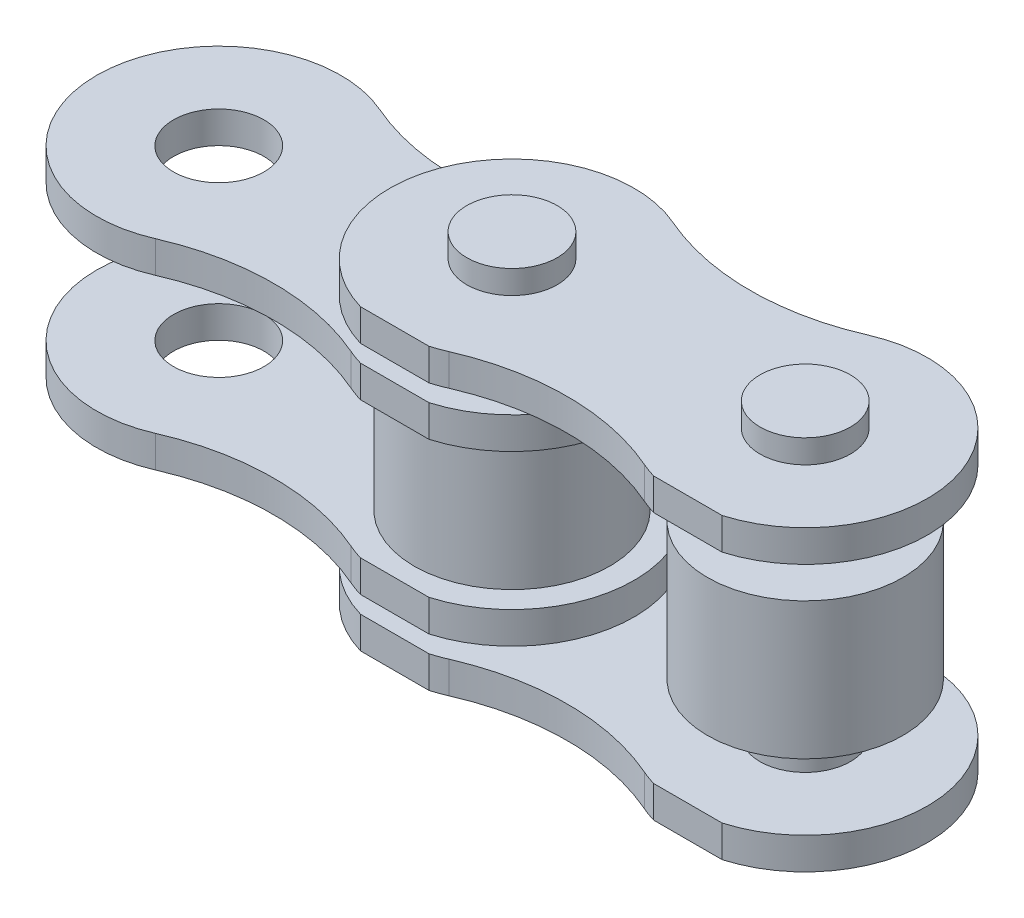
ISO-10303-21;
HEADER;
FILE_DESCRIPTION(('STEP AP214'),'2;1');
FILE_NAME('part.step','',(''),(''),'','','');
FILE_SCHEMA(('AUTOMOTIVE_DESIGN { 1 0 10303 214 1 1 1 1 }'));
ENDSEC;
DATA;
#1=APPLICATION_CONTEXT('core data for automotive mechanical design processes');
#2=APPLICATION_PROTOCOL_DEFINITION('international standard','automotive_design',2000,#1);
#3=PRODUCT_CONTEXT('',#1,'mechanical');
#4=PRODUCT('Part','Part','',(#3));
#5=PRODUCT_RELATED_PRODUCT_CATEGORY('part','',(#4));
#6=PRODUCT_DEFINITION_FORMATION('','',#4);
#7=PRODUCT_DEFINITION_CONTEXT('part definition',#1,'design');
#8=PRODUCT_DEFINITION('design','',#6,#7);
#9=PRODUCT_DEFINITION_SHAPE('','',#8);
#10=(LENGTH_UNIT() NAMED_UNIT(*) SI_UNIT(.MILLI.,.METRE.));
#11=(NAMED_UNIT(*) PLANE_ANGLE_UNIT() SI_UNIT($,.RADIAN.));
#12=(NAMED_UNIT(*) SI_UNIT($,.STERADIAN.) SOLID_ANGLE_UNIT());
#13=UNCERTAINTY_MEASURE_WITH_UNIT(LENGTH_MEASURE(1.E-05),#10,'distance_accuracy_value','');
#14=(GEOMETRIC_REPRESENTATION_CONTEXT(3) GLOBAL_UNCERTAINTY_ASSIGNED_CONTEXT((#13)) GLOBAL_UNIT_ASSIGNED_CONTEXT((#10,
#11,#12)) REPRESENTATION_CONTEXT('',''));
#15=CARTESIAN_POINT('',(0.,0.,0.));
#16=DIRECTION('',(0.,0.,1.));
#17=DIRECTION('',(1.,0.,0.));
#18=AXIS2_PLACEMENT_3D('',#15,#16,#17);
#19=CARTESIAN_POINT('',(12.,-1.5,0.));
#20=DIRECTION('',(0.,-1.,0.));
#21=DIRECTION('',(0.,0.,-1.));
#22=AXIS2_PLACEMENT_3D('',#19,#20,#21);
#23=PLANE('',#22);
#24=CARTESIAN_POINT('',(12.,-1.5,0.));
#25=DIRECTION('',(0.,1.,0.));
#26=DIRECTION('',(0.,0.,1.));
#27=AXIS2_PLACEMENT_3D('',#24,#25,#26);
#28=CIRCLE('',#27,0.925);
#29=CARTESIAN_POINT('',(12.,-1.5,0.925));
#30=VERTEX_POINT('',#29);
#31=EDGE_CURVE('E591',#30,#30,#28,.T.);
#32=ORIENTED_EDGE('',*,*,#31,.F.);
#33=EDGE_LOOP('',(#32));
#34=FACE_BOUND('',#33,.T.);
#35=ADVANCED_FACE('F16',(#34),#23,.T.);
#36=CARTESIAN_POINT('',(6.,-1.5,0.));
#37=DIRECTION('',(0.,-1.,0.));
#38=DIRECTION('',(0.,0.,-1.));
#39=AXIS2_PLACEMENT_3D('',#36,#37,#38);
#40=PLANE('',#39);
#41=CARTESIAN_POINT('',(6.,-1.5,0.));
#42=DIRECTION('',(0.,1.,0.));
#43=DIRECTION('',(0.,0.,1.));
#44=AXIS2_PLACEMENT_3D('',#41,#42,#43);
#45=CIRCLE('',#44,0.925);
#46=CARTESIAN_POINT('',(6.,-1.5,0.925));
#47=VERTEX_POINT('',#46);
#48=EDGE_CURVE('E586',#47,#47,#45,.T.);
#49=ORIENTED_EDGE('',*,*,#48,.F.);
#50=EDGE_LOOP('',(#49));
#51=FACE_BOUND('',#50,.T.);
#52=ADVANCED_FACE('F600',(#51),#40,.T.);
#53=CARTESIAN_POINT('',(12.,2.04,0.));
#54=DIRECTION('',(0.,1.,0.));
#55=DIRECTION('',(0.,0.,1.));
#56=AXIS2_PLACEMENT_3D('',#53,#54,#55);
#57=CYLINDRICAL_SURFACE('',#56,0.925);
#58=ORIENTED_EDGE('',*,*,#31,.T.);
#59=EDGE_LOOP('',(#58));
#60=FACE_BOUND('',#59,.T.);
#61=CARTESIAN_POINT('',(12.,-1.,0.));
#62=DIRECTION('',(0.,1.,0.));
#63=DIRECTION('',(0.,0.,1.));
#64=AXIS2_PLACEMENT_3D('',#61,#62,#63);
#65=CIRCLE('',#64,0.925);
#66=CARTESIAN_POINT('',(12.,-1.,0.925));
#67=VERTEX_POINT('',#66);
#68=EDGE_CURVE('E577',#67,#67,#65,.T.);
#69=ORIENTED_EDGE('',*,*,#68,.F.);
#70=EDGE_LOOP('',(#69));
#71=FACE_BOUND('',#70,.T.);
#72=ADVANCED_FACE('F596',(#60,#71),#57,.T.);
#73=CARTESIAN_POINT('',(6.,2.04,0.));
#74=DIRECTION('',(0.,1.,0.));
#75=DIRECTION('',(0.,0.,1.));
#76=AXIS2_PLACEMENT_3D('',#73,#74,#75);
#77=CYLINDRICAL_SURFACE('',#76,0.925);
#78=ORIENTED_EDGE('',*,*,#48,.T.);
#79=EDGE_LOOP('',(#78));
#80=FACE_BOUND('',#79,.T.);
#81=CARTESIAN_POINT('',(6.,-1.,0.));
#82=DIRECTION('',(0.,1.,0.));
#83=DIRECTION('',(0.,0.,1.));
#84=AXIS2_PLACEMENT_3D('',#81,#82,#83);
#85=CIRCLE('',#84,0.925);
#86=CARTESIAN_POINT('',(6.,-1.,0.925));
#87=VERTEX_POINT('',#86);
#88=EDGE_CURVE('E573',#87,#87,#85,.T.);
#89=ORIENTED_EDGE('',*,*,#88,.F.);
#90=EDGE_LOOP('',(#89));
#91=FACE_BOUND('',#90,.T.);
#92=ADVANCED_FACE('F1051',(#80,#91),#77,.T.);
#93=CARTESIAN_POINT('',(6.,-1.,0.));
#94=DIRECTION('',(0.,-1.,0.));
#95=DIRECTION('',(0.,0.,-1.));
#96=AXIS2_PLACEMENT_3D('',#93,#94,#95);
#97=PLANE('',#96);
#98=ORIENTED_EDGE('',*,*,#88,.T.);
#99=EDGE_LOOP('',(#98));
#100=FACE_BOUND('',#99,.T.);
#101=ORIENTED_EDGE('',*,*,#68,.T.);
#102=EDGE_LOOP('',(#101));
#103=FACE_BOUND('',#102,.T.);
#104=CARTESIAN_POINT('',(9.,-1.,-6.874));
#105=DIRECTION('',(0.,1.,0.));
#106=DIRECTION('',(0.,0.,1.));
#107=AXIS2_PLACEMENT_3D('',#104,#105,#106);
#108=CIRCLE('',#107,5.);
#109=CARTESIAN_POINT('',(7.00012849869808,-1.,-2.2913));
#110=VERTEX_POINT('',#109);
#111=CARTESIAN_POINT('',(10.9998715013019,-1.,-2.2913));
#112=VERTEX_POINT('',#111);
#113=EDGE_CURVE('E562',#110,#112,#108,.T.);
#114=ORIENTED_EDGE('',*,*,#113,.T.);
#115=CARTESIAN_POINT('',(12.,-1.,0.));
#116=DIRECTION('',(0.,1.,0.));
#117=DIRECTION('',(0.,0.,1.));
#118=AXIS2_PLACEMENT_3D('',#115,#116,#117);
#119=CIRCLE('',#118,2.5);
#120=CARTESIAN_POINT('',(12.7000000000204,-1.,2.39999999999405));
#121=VERTEX_POINT('',#120);
#122=EDGE_CURVE('E565',#121,#112,#119,.T.);
#123=ORIENTED_EDGE('',*,*,#122,.F.);
#124=DIRECTION('',(-1.,0.,8.877819E-13));
#125=VECTOR('',#124,1.);
#126=CARTESIAN_POINT('',(11.2999999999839,-1.,2.39999999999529));
#127=LINE('',#126,#125);
#128=CARTESIAN_POINT('',(11.2999999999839,-1.,2.39999999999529));
#129=VERTEX_POINT('',#128);
#130=EDGE_CURVE('E576',#121,#129,#127,.T.);
#131=ORIENTED_EDGE('',*,*,#130,.T.);
#132=CARTESIAN_POINT('',(12.,-1.,0.));
#133=DIRECTION('',(0.,1.,0.));
#134=DIRECTION('',(0.,0.,1.));
#135=AXIS2_PLACEMENT_3D('',#132,#133,#134);
#136=CIRCLE('',#135,2.5);
#137=CARTESIAN_POINT('',(10.9998715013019,-1.,2.2913));
#138=VERTEX_POINT('',#137);
#139=EDGE_CURVE('E582',#129,#138,#136,.F.);
#140=ORIENTED_EDGE('',*,*,#139,.T.);
#141=CARTESIAN_POINT('',(9.,-0.999999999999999,6.874));
#142=DIRECTION('',(0.,1.,0.));
#143=DIRECTION('',(0.,0.,1.));
#144=AXIS2_PLACEMENT_3D('',#141,#142,#143);
#145=CIRCLE('',#144,5.);
#146=CARTESIAN_POINT('',(7.00012849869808,-1.,2.2913));
#147=VERTEX_POINT('',#146);
#148=EDGE_CURVE('E544',#138,#147,#145,.T.);
#149=ORIENTED_EDGE('',*,*,#148,.T.);
#150=CARTESIAN_POINT('',(6.,-1.,0.));
#151=DIRECTION('',(0.,1.,0.));
#152=DIRECTION('',(0.,0.,1.));
#153=AXIS2_PLACEMENT_3D('',#150,#151,#152);
#154=CIRCLE('',#153,2.5);
#155=CARTESIAN_POINT('',(6.70000000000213,-1.,2.39999999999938));
#156=VERTEX_POINT('',#155);
#157=EDGE_CURVE('E547',#156,#147,#154,.T.);
#158=ORIENTED_EDGE('',*,*,#157,.F.);
#159=DIRECTION('',(-1.,0.,8.877819E-13));
#160=VECTOR('',#159,1.);
#161=CARTESIAN_POINT('',(5.30000000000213,-1.,2.40000000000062));
#162=LINE('',#161,#160);
#163=CARTESIAN_POINT('',(5.30000000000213,-1.,2.40000000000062));
#164=VERTEX_POINT('',#163);
#165=EDGE_CURVE('E558',#156,#164,#162,.T.);
#166=ORIENTED_EDGE('',*,*,#165,.T.);
#167=CARTESIAN_POINT('',(6.,-1.,0.));
#168=DIRECTION('',(0.,1.,0.));
#169=DIRECTION('',(0.,0.,1.));
#170=AXIS2_PLACEMENT_3D('',#167,#168,#169);
#171=CIRCLE('',#170,2.5);
#172=EDGE_CURVE('E555',#110,#164,#171,.T.);
#173=ORIENTED_EDGE('',*,*,#172,.F.);
#174=EDGE_LOOP('',(#114,#123,#131,#140,#149,#158,#166,#173));
#175=FACE_BOUND('',#174,.T.);
#176=ADVANCED_FACE('F1038',(#100,#103,#175),#97,.T.);
#177=CARTESIAN_POINT('',(11.2999999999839,-1.,2.39999999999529));
#178=DIRECTION('',(-8.877819E-13,0.,-1.));
#179=DIRECTION('',(-1.,0.,8.877819E-13));
#180=AXIS2_PLACEMENT_3D('',#177,#178,#179);
#181=PLANE('',#180);
#182=DIRECTION('',(0.,1.,0.));
#183=VECTOR('',#182,1.);
#184=CARTESIAN_POINT('',(11.2999999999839,-0.674999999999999,2.39999999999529));
#185=LINE('',#184,#183);
#186=CARTESIAN_POINT('',(11.2999999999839,-0.35,2.39999999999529));
#187=VERTEX_POINT('',#186);
#188=EDGE_CURVE('E915',#129,#187,#185,.T.);
#189=ORIENTED_EDGE('',*,*,#188,.F.);
#190=ORIENTED_EDGE('',*,*,#130,.F.);
#191=DIRECTION('',(0.,1.,0.));
#192=VECTOR('',#191,1.);
#193=CARTESIAN_POINT('',(12.7000000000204,-0.674999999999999,2.39999999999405));
#194=LINE('',#193,#192);
#195=CARTESIAN_POINT('',(12.7000000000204,-0.35,2.39999999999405));
#196=VERTEX_POINT('',#195);
#197=EDGE_CURVE('E570',#196,#121,#194,.F.);
#198=ORIENTED_EDGE('',*,*,#197,.F.);
#199=DIRECTION('',(1.,0.,0.));
#200=VECTOR('',#199,1.);
#201=CARTESIAN_POINT('',(6.,-0.35,2.39999999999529));
#202=LINE('',#201,#200);
#203=EDGE_CURVE('E541',#187,#196,#202,.T.);
#204=ORIENTED_EDGE('',*,*,#203,.F.);
#205=EDGE_LOOP('',(#189,#190,#198,#204));
#206=FACE_BOUND('',#205,.T.);
#207=ADVANCED_FACE('F1045',(#206),#181,.F.);
#208=CARTESIAN_POINT('',(12.,-0.675,0.));
#209=DIRECTION('',(0.,1.,0.));
#210=DIRECTION('',(0.,0.,1.));
#211=AXIS2_PLACEMENT_3D('',#208,#209,#210);
#212=CYLINDRICAL_SURFACE('',#211,2.5);
#213=CARTESIAN_POINT('',(11.0000278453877,-1.,-2.2913));
#214=DIRECTION('',(0.,1.,0.));
#215=VECTOR('',#214,1.);
#216=LINE('',#213,#215);
#217=CARTESIAN_POINT('',(10.9998715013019,-0.350000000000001,-2.2913));
#218=VERTEX_POINT('',#217);
#219=EDGE_CURVE('E564',#112,#218,#216,.T.);
#220=ORIENTED_EDGE('',*,*,#219,.T.);
#221=CARTESIAN_POINT('',(12.,-0.35,0.));
#222=DIRECTION('',(0.,1.,0.));
#223=DIRECTION('',(0.,0.,1.));
#224=AXIS2_PLACEMENT_3D('',#221,#222,#223);
#225=CIRCLE('',#224,2.5);
#226=EDGE_CURVE('E536',#196,#218,#225,.T.);
#227=ORIENTED_EDGE('',*,*,#226,.F.);
#228=ORIENTED_EDGE('',*,*,#197,.T.);
#229=ORIENTED_EDGE('',*,*,#122,.T.);
#230=EDGE_LOOP('',(#220,#227,#228,#229));
#231=FACE_BOUND('',#230,.T.);
#232=ADVANCED_FACE('F1007',(#231),#212,.T.);
#233=CARTESIAN_POINT('',(9.,-0.675000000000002,-6.874));
#234=DIRECTION('',(0.,1.,0.));
#235=DIRECTION('',(0.,0.,1.));
#236=AXIS2_PLACEMENT_3D('',#233,#234,#235);
#237=CYLINDRICAL_SURFACE('',#236,5.);
#238=ORIENTED_EDGE('',*,*,#113,.F.);
#239=CARTESIAN_POINT('',(6.99997215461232,-0.35,-2.2913));
#240=DIRECTION('',(0.,-1.,0.));
#241=VECTOR('',#240,1.);
#242=LINE('',#239,#241);
#243=CARTESIAN_POINT('',(7.00012849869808,-0.35,-2.2913));
#244=VERTEX_POINT('',#243);
#245=EDGE_CURVE('E559',#244,#110,#242,.T.);
#246=ORIENTED_EDGE('',*,*,#245,.F.);
#247=CARTESIAN_POINT('',(9.,-0.350000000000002,-6.874));
#248=DIRECTION('',(0.,1.,0.));
#249=DIRECTION('',(0.,0.,1.));
#250=AXIS2_PLACEMENT_3D('',#247,#248,#249);
#251=CIRCLE('',#250,5.);
#252=EDGE_CURVE('E531',#218,#244,#251,.F.);
#253=ORIENTED_EDGE('',*,*,#252,.F.);
#254=ORIENTED_EDGE('',*,*,#219,.F.);
#255=EDGE_LOOP('',(#238,#246,#253,#254));
#256=FACE_BOUND('',#255,.T.);
#257=ADVANCED_FACE('F1003',(#256),#237,.F.);
#258=CARTESIAN_POINT('',(6.,-0.675,0.));
#259=DIRECTION('',(0.,1.,0.));
#260=DIRECTION('',(0.,0.,1.));
#261=AXIS2_PLACEMENT_3D('',#258,#259,#260);
#262=CYLINDRICAL_SURFACE('',#261,2.5);
#263=ORIENTED_EDGE('',*,*,#245,.T.);
#264=ORIENTED_EDGE('',*,*,#172,.T.);
#265=DIRECTION('',(0.,1.,0.));
#266=VECTOR('',#265,1.);
#267=CARTESIAN_POINT('',(5.30000000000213,-1.,2.40000000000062));
#268=LINE('',#267,#266);
#269=CARTESIAN_POINT('',(5.30000000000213,-0.35,2.40000000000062));
#270=VERTEX_POINT('',#269);
#271=EDGE_CURVE('E920',#164,#270,#268,.T.);
#272=ORIENTED_EDGE('',*,*,#271,.T.);
#273=CARTESIAN_POINT('',(6.,-0.35,0.));
#274=DIRECTION('',(0.,1.,0.));
#275=DIRECTION('',(0.,0.,1.));
#276=AXIS2_PLACEMENT_3D('',#273,#274,#275);
#277=CIRCLE('',#276,2.5);
#278=EDGE_CURVE('E528',#244,#270,#277,.T.);
#279=ORIENTED_EDGE('',*,*,#278,.F.);
#280=EDGE_LOOP('',(#263,#264,#272,#279));
#281=FACE_BOUND('',#280,.T.);
#282=ADVANCED_FACE('F993',(#281),#262,.T.);
#283=CARTESIAN_POINT('',(5.30000000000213,-1.,2.40000000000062));
#284=DIRECTION('',(-8.877819E-13,0.,-1.));
#285=DIRECTION('',(-1.,0.,8.877819E-13));
#286=AXIS2_PLACEMENT_3D('',#283,#284,#285);
#287=PLANE('',#286);
#288=ORIENTED_EDGE('',*,*,#271,.F.);
#289=ORIENTED_EDGE('',*,*,#165,.F.);
#290=DIRECTION('',(0.,1.,0.));
#291=VECTOR('',#290,1.);
#292=CARTESIAN_POINT('',(6.70000000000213,-0.674999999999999,2.39999999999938));
#293=LINE('',#292,#291);
#294=CARTESIAN_POINT('',(6.70000000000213,-0.349999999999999,2.39999999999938));
#295=VERTEX_POINT('',#294);
#296=EDGE_CURVE('E552',#295,#156,#293,.F.);
#297=ORIENTED_EDGE('',*,*,#296,.F.);
#298=DIRECTION('',(1.,0.,0.));
#299=VECTOR('',#298,1.);
#300=CARTESIAN_POINT('',(6.,-0.35,2.40000000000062));
#301=LINE('',#300,#299);
#302=EDGE_CURVE('E525',#270,#295,#301,.T.);
#303=ORIENTED_EDGE('',*,*,#302,.F.);
#304=EDGE_LOOP('',(#288,#289,#297,#303));
#305=FACE_BOUND('',#304,.T.);
#306=ADVANCED_FACE('F1002',(#305),#287,.F.);
#307=CARTESIAN_POINT('',(6.,-0.675,0.));
#308=DIRECTION('',(0.,1.,0.));
#309=DIRECTION('',(0.,0.,1.));
#310=AXIS2_PLACEMENT_3D('',#307,#308,#309);
#311=CYLINDRICAL_SURFACE('',#310,2.5);
#312=CARTESIAN_POINT('',(6.99997215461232,-1.,2.2913));
#313=DIRECTION('',(0.,1.,0.));
#314=VECTOR('',#313,1.);
#315=LINE('',#312,#314);
#316=CARTESIAN_POINT('',(7.00012849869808,-0.349999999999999,2.2913));
#317=VERTEX_POINT('',#316);
#318=EDGE_CURVE('E546',#147,#317,#315,.T.);
#319=ORIENTED_EDGE('',*,*,#318,.T.);
#320=CARTESIAN_POINT('',(6.,-0.349999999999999,0.));
#321=DIRECTION('',(0.,1.,0.));
#322=DIRECTION('',(0.,0.,1.));
#323=AXIS2_PLACEMENT_3D('',#320,#321,#322);
#324=CIRCLE('',#323,2.5);
#325=EDGE_CURVE('E520',#295,#317,#324,.T.);
#326=ORIENTED_EDGE('',*,*,#325,.F.);
#327=ORIENTED_EDGE('',*,*,#296,.T.);
#328=ORIENTED_EDGE('',*,*,#157,.T.);
#329=EDGE_LOOP('',(#319,#326,#327,#328));
#330=FACE_BOUND('',#329,.T.);
#331=ADVANCED_FACE('F949',(#330),#311,.T.);
#332=CARTESIAN_POINT('',(9.,-0.674999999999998,6.874));
#333=DIRECTION('',(0.,1.,0.));
#334=DIRECTION('',(0.,0.,1.));
#335=AXIS2_PLACEMENT_3D('',#332,#333,#334);
#336=CYLINDRICAL_SURFACE('',#335,5.);
#337=CARTESIAN_POINT('',(9.,-0.349999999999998,6.874));
#338=DIRECTION('',(0.,1.,0.));
#339=DIRECTION('',(0.,0.,1.));
#340=AXIS2_PLACEMENT_3D('',#337,#338,#339);
#341=CIRCLE('',#340,5.);
#342=CARTESIAN_POINT('',(10.9998715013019,-0.349999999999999,2.2913));
#343=VERTEX_POINT('',#342);
#344=EDGE_CURVE('E515',#317,#343,#341,.F.);
#345=ORIENTED_EDGE('',*,*,#344,.F.);
#346=ORIENTED_EDGE('',*,*,#318,.F.);
#347=ORIENTED_EDGE('',*,*,#148,.F.);
#348=CARTESIAN_POINT('',(11.0000278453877,-0.349999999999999,2.2913));
#349=DIRECTION('',(0.,-1.,0.));
#350=VECTOR('',#349,1.);
#351=LINE('',#348,#350);
#352=EDGE_CURVE('E914',#343,#138,#351,.T.);
#353=ORIENTED_EDGE('',*,*,#352,.F.);
#354=EDGE_LOOP('',(#345,#346,#347,#353));
#355=FACE_BOUND('',#354,.T.);
#356=ADVANCED_FACE('F944',(#355),#336,.F.);
#357=CARTESIAN_POINT('',(12.,-0.675,0.));
#358=DIRECTION('',(0.,1.,0.));
#359=DIRECTION('',(0.,0.,1.));
#360=AXIS2_PLACEMENT_3D('',#357,#358,#359);
#361=CYLINDRICAL_SURFACE('',#360,2.5);
#362=ORIENTED_EDGE('',*,*,#352,.T.);
#363=ORIENTED_EDGE('',*,*,#139,.F.);
#364=ORIENTED_EDGE('',*,*,#188,.T.);
#365=CARTESIAN_POINT('',(12.,-0.35,0.));
#366=DIRECTION('',(0.,1.,0.));
#367=DIRECTION('',(0.,0.,1.));
#368=AXIS2_PLACEMENT_3D('',#365,#366,#367);
#369=CIRCLE('',#368,2.5);
#370=EDGE_CURVE('E510',#343,#187,#369,.T.);
#371=ORIENTED_EDGE('',*,*,#370,.F.);
#372=EDGE_LOOP('',(#362,#363,#364,#371));
#373=FACE_BOUND('',#372,.T.);
#374=ADVANCED_FACE('F933',(#373),#361,.T.);
#375=CARTESIAN_POINT('',(6.,-0.35,0.));
#376=DIRECTION('',(0.,1.,0.));
#377=DIRECTION('',(0.,0.,1.));
#378=AXIS2_PLACEMENT_3D('',#375,#376,#377);
#379=PLANE('',#378);
#380=CARTESIAN_POINT('',(12.,-0.35,0.));
#381=DIRECTION('',(0.,1.,0.));
#382=DIRECTION('',(0.,0.,1.));
#383=AXIS2_PLACEMENT_3D('',#380,#381,#382);
#384=CIRCLE('',#383,0.925);
#385=CARTESIAN_POINT('',(12.,-0.35,0.925));
#386=VERTEX_POINT('',#385);
#387=EDGE_CURVE('E505',#386,#386,#384,.T.);
#388=ORIENTED_EDGE('',*,*,#387,.F.);
#389=EDGE_LOOP('',(#388));
#390=FACE_BOUND('',#389,.T.);
#391=CARTESIAN_POINT('',(6.,-0.35,0.));
#392=DIRECTION('',(0.,1.,0.));
#393=DIRECTION('',(0.,0.,1.));
#394=AXIS2_PLACEMENT_3D('',#391,#392,#393);
#395=CIRCLE('',#394,0.925);
#396=CARTESIAN_POINT('',(6.,-0.35,0.925));
#397=VERTEX_POINT('',#396);
#398=EDGE_CURVE('E500',#397,#397,#395,.T.);
#399=ORIENTED_EDGE('',*,*,#398,.F.);
#400=EDGE_LOOP('',(#399));
#401=FACE_BOUND('',#400,.T.);
#402=ORIENTED_EDGE('',*,*,#344,.T.);
#403=ORIENTED_EDGE('',*,*,#370,.T.);
#404=ORIENTED_EDGE('',*,*,#203,.T.);
#405=ORIENTED_EDGE('',*,*,#226,.T.);
#406=ORIENTED_EDGE('',*,*,#252,.T.);
#407=ORIENTED_EDGE('',*,*,#278,.T.);
#408=ORIENTED_EDGE('',*,*,#302,.T.);
#409=ORIENTED_EDGE('',*,*,#325,.T.);
#410=EDGE_LOOP('',(#402,#403,#404,#405,#406,#407,#408,#409));
#411=FACE_BOUND('',#410,.T.);
#412=ADVANCED_FACE('F943',(#390,#401,#411),#379,.T.);
#413=CARTESIAN_POINT('',(12.,2.04,0.));
#414=DIRECTION('',(0.,1.,0.));
#415=DIRECTION('',(0.,0.,1.));
#416=AXIS2_PLACEMENT_3D('',#413,#414,#415);
#417=CYLINDRICAL_SURFACE('',#416,0.925);
#418=ORIENTED_EDGE('',*,*,#387,.T.);
#419=EDGE_LOOP('',(#418));
#420=FACE_BOUND('',#419,.T.);
#421=CARTESIAN_POINT('',(12.,0.65,0.));
#422=DIRECTION('',(0.,1.,0.));
#423=DIRECTION('',(0.,0.,1.));
#424=AXIS2_PLACEMENT_3D('',#421,#422,#423);
#425=CIRCLE('',#424,0.925);
#426=CARTESIAN_POINT('',(12.,0.65,0.925));
#427=VERTEX_POINT('',#426);
#428=EDGE_CURVE('E495',#427,#427,#425,.T.);
#429=ORIENTED_EDGE('',*,*,#428,.F.);
#430=EDGE_LOOP('',(#429));
#431=FACE_BOUND('',#430,.T.);
#432=ADVANCED_FACE('F1115',(#420,#431),#417,.T.);
#433=CARTESIAN_POINT('',(6.,2.04,0.));
#434=DIRECTION('',(0.,1.,0.));
#435=DIRECTION('',(0.,0.,1.));
#436=AXIS2_PLACEMENT_3D('',#433,#434,#435);
#437=CYLINDRICAL_SURFACE('',#436,0.925);
#438=ORIENTED_EDGE('',*,*,#398,.T.);
#439=EDGE_LOOP('',(#438));
#440=FACE_BOUND('',#439,.T.);
#441=CARTESIAN_POINT('',(6.,0.,0.));
#442=DIRECTION('',(0.,1.,0.));
#443=DIRECTION('',(0.,0.,1.));
#444=AXIS2_PLACEMENT_3D('',#441,#442,#443);
#445=CIRCLE('',#444,0.925);
#446=CARTESIAN_POINT('',(6.,0.,0.925));
#447=VERTEX_POINT('',#446);
#448=EDGE_CURVE('E490',#447,#447,#445,.T.);
#449=ORIENTED_EDGE('',*,*,#448,.F.);
#450=EDGE_LOOP('',(#449));
#451=FACE_BOUND('',#450,.T.);
#452=ADVANCED_FACE('F1122',(#440,#451),#437,.T.);
#453=CARTESIAN_POINT('',(6.,5.58,0.));
#454=DIRECTION('',(0.,1.,0.));
#455=DIRECTION('',(0.,0.,1.));
#456=AXIS2_PLACEMENT_3D('',#453,#454,#455);
#457=PLANE('',#456);
#458=CARTESIAN_POINT('',(6.,5.58,0.));
#459=DIRECTION('',(0.,1.,0.));
#460=DIRECTION('',(0.,0.,1.));
#461=AXIS2_PLACEMENT_3D('',#458,#459,#460);
#462=CIRCLE('',#461,0.925);
#463=CARTESIAN_POINT('',(6.,5.58,0.924999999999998));
#464=VERTEX_POINT('',#463);
#465=EDGE_CURVE('E485',#464,#464,#462,.F.);
#466=ORIENTED_EDGE('',*,*,#465,.F.);
#467=EDGE_LOOP('',(#466));
#468=FACE_BOUND('',#467,.T.);
#469=ADVANCED_FACE('F1129',(#468),#457,.T.);
#470=CARTESIAN_POINT('',(12.,5.58,0.));
#471=DIRECTION('',(0.,1.,0.));
#472=DIRECTION('',(0.,0.,1.));
#473=AXIS2_PLACEMENT_3D('',#470,#471,#472);
#474=PLANE('',#473);
#475=CARTESIAN_POINT('',(12.,5.58,0.));
#476=DIRECTION('',(0.,1.,0.));
#477=DIRECTION('',(0.,0.,1.));
#478=AXIS2_PLACEMENT_3D('',#475,#476,#477);
#479=CIRCLE('',#478,0.925);
#480=CARTESIAN_POINT('',(12.,5.58,0.924999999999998));
#481=VERTEX_POINT('',#480);
#482=EDGE_CURVE('E480',#481,#481,#479,.F.);
#483=ORIENTED_EDGE('',*,*,#482,.F.);
#484=EDGE_LOOP('',(#483));
#485=FACE_BOUND('',#484,.T.);
#486=ADVANCED_FACE('F1137',(#485),#474,.T.);
#487=CARTESIAN_POINT('',(12.,0.65,0.));
#488=DIRECTION('',(0.,-1.,0.));
#489=DIRECTION('',(0.,0.,-1.));
#490=AXIS2_PLACEMENT_3D('',#487,#488,#489);
#491=PLANE('',#490);
#492=ORIENTED_EDGE('',*,*,#428,.T.);
#493=EDGE_LOOP('',(#492));
#494=FACE_BOUND('',#493,.T.);
#495=CARTESIAN_POINT('',(12.,0.65,0.));
#496=DIRECTION('',(0.,1.,0.));
#497=DIRECTION('',(0.,0.,1.));
#498=AXIS2_PLACEMENT_3D('',#495,#496,#497);
#499=CIRCLE('',#498,2.);
#500=CARTESIAN_POINT('',(12.,0.65,2.));
#501=VERTEX_POINT('',#500);
#502=EDGE_CURVE('E476',#501,#501,#499,.T.);
#503=ORIENTED_EDGE('',*,*,#502,.F.);
#504=EDGE_LOOP('',(#503));
#505=FACE_BOUND('',#504,.T.);
#506=ADVANCED_FACE('F1145',(#494,#505),#491,.T.);
#507=CARTESIAN_POINT('',(0.,0.,0.));
#508=DIRECTION('',(0.,-1.,0.));
#509=DIRECTION('',(0.,0.,-1.));
#510=AXIS2_PLACEMENT_3D('',#507,#508,#509);
#511=PLANE('',#510);
#512=CARTESIAN_POINT('',(0.,0.,0.));
#513=DIRECTION('',(0.,1.,0.));
#514=DIRECTION('',(0.,0.,1.));
#515=AXIS2_PLACEMENT_3D('',#512,#513,#514);
#516=CIRCLE('',#515,0.925);
#517=CARTESIAN_POINT('',(0.,0.,0.925));
#518=VERTEX_POINT('',#517);
#519=EDGE_CURVE('E441',#518,#518,#516,.T.);
#520=ORIENTED_EDGE('',*,*,#519,.T.);
#521=EDGE_LOOP('',(#520));
#522=FACE_BOUND('',#521,.T.);
#523=ORIENTED_EDGE('',*,*,#448,.T.);
#524=EDGE_LOOP('',(#523));
#525=FACE_BOUND('',#524,.T.);
#526=CARTESIAN_POINT('',(3.,0.,-6.874));
#527=DIRECTION('',(0.,1.,0.));
#528=DIRECTION('',(0.,0.,1.));
#529=AXIS2_PLACEMENT_3D('',#526,#527,#528);
#530=CIRCLE('',#529,5.);
#531=CARTESIAN_POINT('',(1.00012849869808,0.,-2.2913));
#532=VERTEX_POINT('',#531);
#533=CARTESIAN_POINT('',(4.99987150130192,0.,-2.2913));
#534=VERTEX_POINT('',#533);
#535=EDGE_CURVE('E465',#532,#534,#530,.T.);
#536=ORIENTED_EDGE('',*,*,#535,.T.);
#537=CARTESIAN_POINT('',(6.,0.,0.));
#538=DIRECTION('',(0.,1.,0.));
#539=DIRECTION('',(0.,0.,1.));
#540=AXIS2_PLACEMENT_3D('',#537,#538,#539);
#541=CIRCLE('',#540,2.5);
#542=CARTESIAN_POINT('',(6.70000000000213,0.,2.39999999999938));
#543=VERTEX_POINT('',#542);
#544=EDGE_CURVE('E468',#543,#534,#541,.T.);
#545=ORIENTED_EDGE('',*,*,#544,.F.);
#546=DIRECTION('',(-1.,0.,8.877819E-13));
#547=VECTOR('',#546,1.);
#548=CARTESIAN_POINT('',(5.30000000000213,0.,2.40000000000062));
#549=LINE('',#548,#547);
#550=CARTESIAN_POINT('',(5.30000000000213,0.,2.40000000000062));
#551=VERTEX_POINT('',#550);
#552=EDGE_CURVE('E479',#543,#551,#549,.T.);
#553=ORIENTED_EDGE('',*,*,#552,.T.);
#554=CARTESIAN_POINT('',(6.,0.,0.));
#555=DIRECTION('',(0.,1.,0.));
#556=DIRECTION('',(0.,0.,1.));
#557=AXIS2_PLACEMENT_3D('',#554,#555,#556);
#558=CIRCLE('',#557,2.5);
#559=CARTESIAN_POINT('',(4.99987150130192,0.,2.2913));
#560=VERTEX_POINT('',#559);
#561=EDGE_CURVE('E446',#560,#551,#558,.T.);
#562=ORIENTED_EDGE('',*,*,#561,.F.);
#563=CARTESIAN_POINT('',(3.,0.,6.874));
#564=DIRECTION('',(0.,1.,0.));
#565=DIRECTION('',(0.,0.,1.));
#566=AXIS2_PLACEMENT_3D('',#563,#564,#565);
#567=CIRCLE('',#566,5.);
#568=CARTESIAN_POINT('',(1.00012849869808,0.,2.2913));
#569=VERTEX_POINT('',#568);
#570=EDGE_CURVE('E454',#560,#569,#567,.T.);
#571=ORIENTED_EDGE('',*,*,#570,.T.);
#572=CARTESIAN_POINT('',(0.,0.,0.));
#573=DIRECTION('',(0.,1.,0.));
#574=DIRECTION('',(0.,0.,1.));
#575=AXIS2_PLACEMENT_3D('',#572,#573,#574);
#576=CIRCLE('',#575,2.5);
#577=EDGE_CURVE('E457',#532,#569,#576,.T.);
#578=ORIENTED_EDGE('',*,*,#577,.F.);
#579=EDGE_LOOP('',(#536,#545,#553,#562,#571,#578));
#580=FACE_BOUND('',#579,.T.);
#581=ADVANCED_FACE('F1153',(#522,#525,#580),#511,.T.);
#582=CARTESIAN_POINT('',(6.,2.04,0.));
#583=DIRECTION('',(0.,1.,0.));
#584=DIRECTION('',(0.,0.,1.));
#585=AXIS2_PLACEMENT_3D('',#582,#583,#584);
#586=CYLINDRICAL_SURFACE('',#585,0.925);
#587=CARTESIAN_POINT('',(6.,5.1,0.));
#588=DIRECTION('',(0.,1.,0.));
#589=DIRECTION('',(0.,0.,1.));
#590=AXIS2_PLACEMENT_3D('',#587,#588,#589);
#591=CIRCLE('',#590,0.925);
#592=CARTESIAN_POINT('',(6.,5.1,0.924999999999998));
#593=VERTEX_POINT('',#592);
#594=EDGE_CURVE('E436',#593,#593,#591,.F.);
#595=ORIENTED_EDGE('',*,*,#594,.F.);
#596=EDGE_LOOP('',(#595));
#597=FACE_BOUND('',#596,.T.);
#598=ORIENTED_EDGE('',*,*,#465,.T.);
#599=EDGE_LOOP('',(#598));
#600=FACE_BOUND('',#599,.T.);
#601=ADVANCED_FACE('F1161',(#597,#600),#586,.T.);
#602=CARTESIAN_POINT('',(12.,2.04,0.));
#603=DIRECTION('',(0.,1.,0.));
#604=DIRECTION('',(0.,0.,1.));
#605=AXIS2_PLACEMENT_3D('',#602,#603,#604);
#606=CYLINDRICAL_SURFACE('',#605,0.925);
#607=CARTESIAN_POINT('',(12.,5.1,0.));
#608=DIRECTION('',(0.,1.,0.));
#609=DIRECTION('',(0.,0.,1.));
#610=AXIS2_PLACEMENT_3D('',#607,#608,#609);
#611=CIRCLE('',#610,0.925);
#612=CARTESIAN_POINT('',(12.,5.1,0.924999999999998));
#613=VERTEX_POINT('',#612);
#614=EDGE_CURVE('E431',#613,#613,#611,.F.);
#615=ORIENTED_EDGE('',*,*,#614,.F.);
#616=EDGE_LOOP('',(#615));
#617=FACE_BOUND('',#616,.T.);
#618=ORIENTED_EDGE('',*,*,#482,.T.);
#619=EDGE_LOOP('',(#618));
#620=FACE_BOUND('',#619,.T.);
#621=ADVANCED_FACE('F1169',(#617,#620),#606,.T.);
#622=CARTESIAN_POINT('',(12.,2.05,0.));
#623=DIRECTION('',(0.,1.,0.));
#624=DIRECTION('',(0.,0.,1.));
#625=AXIS2_PLACEMENT_3D('',#622,#623,#624);
#626=CYLINDRICAL_SURFACE('',#625,2.);
#627=CARTESIAN_POINT('',(12.,3.45,0.));
#628=DIRECTION('',(0.,1.,0.));
#629=DIRECTION('',(0.,0.,1.));
#630=AXIS2_PLACEMENT_3D('',#627,#628,#629);
#631=CIRCLE('',#630,2.);
#632=CARTESIAN_POINT('',(12.,3.45,2.));
#633=VERTEX_POINT('',#632);
#634=EDGE_CURVE('E428',#633,#633,#631,.T.);
#635=ORIENTED_EDGE('',*,*,#634,.F.);
#636=EDGE_LOOP('',(#635));
#637=FACE_BOUND('',#636,.T.);
#638=ORIENTED_EDGE('',*,*,#502,.T.);
#639=EDGE_LOOP('',(#638));
#640=FACE_BOUND('',#639,.T.);
#641=ADVANCED_FACE('F1177',(#637,#640),#626,.T.);
#642=CARTESIAN_POINT('',(5.30000000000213,-1.,2.40000000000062));
#643=DIRECTION('',(-8.877819E-13,0.,-1.));
#644=DIRECTION('',(-1.,0.,8.877819E-13));
#645=AXIS2_PLACEMENT_3D('',#642,#643,#644);
#646=PLANE('',#645);
#647=DIRECTION('',(0.,1.,0.));
#648=VECTOR('',#647,1.);
#649=CARTESIAN_POINT('',(5.30000000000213,0.325,2.40000000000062));
#650=LINE('',#649,#648);
#651=CARTESIAN_POINT('',(5.30000000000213,0.650000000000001,2.40000000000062));
#652=VERTEX_POINT('',#651);
#653=EDGE_CURVE('E792',#551,#652,#650,.T.);
#654=ORIENTED_EDGE('',*,*,#653,.F.);
#655=ORIENTED_EDGE('',*,*,#552,.F.);
#656=DIRECTION('',(0.,1.,0.));
#657=VECTOR('',#656,1.);
#658=CARTESIAN_POINT('',(6.70000000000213,0.325,2.39999999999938));
#659=LINE('',#658,#657);
#660=CARTESIAN_POINT('',(6.70000000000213,0.65,2.39999999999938));
#661=VERTEX_POINT('',#660);
#662=EDGE_CURVE('E473',#661,#543,#659,.F.);
#663=ORIENTED_EDGE('',*,*,#662,.F.);
#664=DIRECTION('',(1.,0.,0.));
#665=VECTOR('',#664,1.);
#666=CARTESIAN_POINT('',(0.,0.65,2.40000000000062));
#667=LINE('',#666,#665);
#668=EDGE_CURVE('E425',#652,#661,#667,.T.);
#669=ORIENTED_EDGE('',*,*,#668,.F.);
#670=EDGE_LOOP('',(#654,#655,#663,#669));
#671=FACE_BOUND('',#670,.T.);
#672=ADVANCED_FACE('F1185',(#671),#646,.F.);
#673=CARTESIAN_POINT('',(6.,0.325,0.));
#674=DIRECTION('',(0.,1.,0.));
#675=DIRECTION('',(0.,0.,1.));
#676=AXIS2_PLACEMENT_3D('',#673,#674,#675);
#677=CYLINDRICAL_SURFACE('',#676,2.5);
#678=CARTESIAN_POINT('',(5.00002784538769,0.,-2.2913));
#679=DIRECTION('',(0.,1.,0.));
#680=VECTOR('',#679,1.);
#681=LINE('',#678,#680);
#682=CARTESIAN_POINT('',(4.99987150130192,0.65,-2.2913));
#683=VERTEX_POINT('',#682);
#684=EDGE_CURVE('E467',#534,#683,#681,.T.);
#685=ORIENTED_EDGE('',*,*,#684,.T.);
#686=CARTESIAN_POINT('',(6.,0.65,0.));
#687=DIRECTION('',(0.,1.,0.));
#688=DIRECTION('',(0.,0.,1.));
#689=AXIS2_PLACEMENT_3D('',#686,#687,#688);
#690=CIRCLE('',#689,2.5);
#691=EDGE_CURVE('E420',#661,#683,#690,.T.);
#692=ORIENTED_EDGE('',*,*,#691,.F.);
#693=ORIENTED_EDGE('',*,*,#662,.T.);
#694=ORIENTED_EDGE('',*,*,#544,.T.);
#695=EDGE_LOOP('',(#685,#692,#693,#694));
#696=FACE_BOUND('',#695,.T.);
#697=ADVANCED_FACE('F887',(#696),#677,.T.);
#698=CARTESIAN_POINT('',(3.,0.324999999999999,-6.874));
#699=DIRECTION('',(0.,1.,0.));
#700=DIRECTION('',(0.,0.,1.));
#701=AXIS2_PLACEMENT_3D('',#698,#699,#700);
#702=CYLINDRICAL_SURFACE('',#701,5.);
#703=ORIENTED_EDGE('',*,*,#535,.F.);
#704=CARTESIAN_POINT('',(0.999972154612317,0.649999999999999,-2.2913));
#705=DIRECTION('',(0.,-1.,0.));
#706=VECTOR('',#705,1.);
#707=LINE('',#704,#706);
#708=CARTESIAN_POINT('',(1.00012849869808,0.65,-2.2913));
#709=VERTEX_POINT('',#708);
#710=EDGE_CURVE('E462',#709,#532,#707,.T.);
#711=ORIENTED_EDGE('',*,*,#710,.F.);
#712=CARTESIAN_POINT('',(3.,0.649999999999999,-6.874));
#713=DIRECTION('',(0.,1.,0.));
#714=DIRECTION('',(0.,0.,1.));
#715=AXIS2_PLACEMENT_3D('',#712,#713,#714);
#716=CIRCLE('',#715,5.);
#717=EDGE_CURVE('E415',#683,#709,#716,.F.);
#718=ORIENTED_EDGE('',*,*,#717,.F.);
#719=ORIENTED_EDGE('',*,*,#684,.F.);
#720=EDGE_LOOP('',(#703,#711,#718,#719));
#721=FACE_BOUND('',#720,.T.);
#722=ADVANCED_FACE('F878',(#721),#702,.F.);
#723=CARTESIAN_POINT('',(0.,0.325,0.));
#724=DIRECTION('',(0.,1.,0.));
#725=DIRECTION('',(0.,0.,1.));
#726=AXIS2_PLACEMENT_3D('',#723,#724,#725);
#727=CYLINDRICAL_SURFACE('',#726,2.5);
#728=ORIENTED_EDGE('',*,*,#710,.T.);
#729=ORIENTED_EDGE('',*,*,#577,.T.);
#730=CARTESIAN_POINT('',(0.999972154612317,0.,2.2913));
#731=DIRECTION('',(0.,1.,0.));
#732=VECTOR('',#731,1.);
#733=LINE('',#730,#732);
#734=CARTESIAN_POINT('',(1.00012849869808,0.65,2.2913));
#735=VERTEX_POINT('',#734);
#736=EDGE_CURVE('E456',#569,#735,#733,.T.);
#737=ORIENTED_EDGE('',*,*,#736,.T.);
#738=CARTESIAN_POINT('',(0.,0.65,0.));
#739=DIRECTION('',(0.,1.,0.));
#740=DIRECTION('',(0.,0.,1.));
#741=AXIS2_PLACEMENT_3D('',#738,#739,#740);
#742=CIRCLE('',#741,2.5);
#743=EDGE_CURVE('E410',#709,#735,#742,.T.);
#744=ORIENTED_EDGE('',*,*,#743,.F.);
#745=EDGE_LOOP('',(#728,#729,#737,#744));
#746=FACE_BOUND('',#745,.T.);
#747=ADVANCED_FACE('F827',(#746),#727,.T.);
#748=CARTESIAN_POINT('',(3.,0.325000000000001,6.874));
#749=DIRECTION('',(0.,1.,0.));
#750=DIRECTION('',(0.,0.,1.));
#751=AXIS2_PLACEMENT_3D('',#748,#749,#750);
#752=CYLINDRICAL_SURFACE('',#751,5.);
#753=CARTESIAN_POINT('',(3.,0.650000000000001,6.874));
#754=DIRECTION('',(0.,1.,0.));
#755=DIRECTION('',(0.,0.,1.));
#756=AXIS2_PLACEMENT_3D('',#753,#754,#755);
#757=CIRCLE('',#756,5.);
#758=CARTESIAN_POINT('',(4.99987150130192,0.65,2.2913));
#759=VERTEX_POINT('',#758);
#760=EDGE_CURVE('E405',#735,#759,#757,.F.);
#761=ORIENTED_EDGE('',*,*,#760,.F.);
#762=ORIENTED_EDGE('',*,*,#736,.F.);
#763=ORIENTED_EDGE('',*,*,#570,.F.);
#764=CARTESIAN_POINT('',(5.00002784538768,0.650000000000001,2.2913));
#765=DIRECTION('',(0.,-1.,0.));
#766=VECTOR('',#765,1.);
#767=LINE('',#764,#766);
#768=EDGE_CURVE('E451',#759,#560,#767,.T.);
#769=ORIENTED_EDGE('',*,*,#768,.F.);
#770=EDGE_LOOP('',(#761,#762,#763,#769));
#771=FACE_BOUND('',#770,.T.);
#772=ADVANCED_FACE('F822',(#771),#752,.F.);
#773=CARTESIAN_POINT('',(6.,0.325,0.));
#774=DIRECTION('',(0.,1.,0.));
#775=DIRECTION('',(0.,0.,1.));
#776=AXIS2_PLACEMENT_3D('',#773,#774,#775);
#777=CYLINDRICAL_SURFACE('',#776,2.5);
#778=ORIENTED_EDGE('',*,*,#768,.T.);
#779=ORIENTED_EDGE('',*,*,#561,.T.);
#780=ORIENTED_EDGE('',*,*,#653,.T.);
#781=CARTESIAN_POINT('',(6.,0.650000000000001,0.));
#782=DIRECTION('',(0.,1.,0.));
#783=DIRECTION('',(0.,0.,1.));
#784=AXIS2_PLACEMENT_3D('',#781,#782,#783);
#785=CIRCLE('',#784,2.5);
#786=EDGE_CURVE('E400',#759,#652,#785,.T.);
#787=ORIENTED_EDGE('',*,*,#786,.F.);
#788=EDGE_LOOP('',(#778,#779,#780,#787));
#789=FACE_BOUND('',#788,.T.);
#790=ADVANCED_FACE('F811',(#789),#777,.T.);
#791=CARTESIAN_POINT('',(0.,0.325,0.));
#792=DIRECTION('',(0.,1.,0.));
#793=DIRECTION('',(0.,0.,1.));
#794=AXIS2_PLACEMENT_3D('',#791,#792,#793);
#795=CYLINDRICAL_SURFACE('',#794,0.925);
#796=CARTESIAN_POINT('',(0.,0.65,0.));
#797=DIRECTION('',(0.,1.,0.));
#798=DIRECTION('',(0.,0.,1.));
#799=AXIS2_PLACEMENT_3D('',#796,#797,#798);
#800=CIRCLE('',#799,0.925);
#801=CARTESIAN_POINT('',(0.,0.65,0.925));
#802=VERTEX_POINT('',#801);
#803=EDGE_CURVE('E396',#802,#802,#800,.F.);
#804=ORIENTED_EDGE('',*,*,#803,.F.);
#805=EDGE_LOOP('',(#804));
#806=FACE_BOUND('',#805,.T.);
#807=ORIENTED_EDGE('',*,*,#519,.F.);
#808=EDGE_LOOP('',(#807));
#809=FACE_BOUND('',#808,.T.);
#810=ADVANCED_FACE('F821',(#806,#809),#795,.F.);
#811=CARTESIAN_POINT('',(6.,5.1,0.));
#812=DIRECTION('',(0.,1.,0.));
#813=DIRECTION('',(0.,0.,1.));
#814=AXIS2_PLACEMENT_3D('',#811,#812,#813);
#815=PLANE('',#814);
#816=ORIENTED_EDGE('',*,*,#614,.T.);
#817=EDGE_LOOP('',(#816));
#818=FACE_BOUND('',#817,.T.);
#819=ORIENTED_EDGE('',*,*,#594,.T.);
#820=EDGE_LOOP('',(#819));
#821=FACE_BOUND('',#820,.T.);
#822=CARTESIAN_POINT('',(9.,5.1,6.874));
#823=DIRECTION('',(0.,1.,0.));
#824=DIRECTION('',(0.,0.,1.));
#825=AXIS2_PLACEMENT_3D('',#822,#823,#824);
#826=CIRCLE('',#825,5.);
#827=CARTESIAN_POINT('',(7.00012849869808,5.1,2.2913));
#828=VERTEX_POINT('',#827);
#829=CARTESIAN_POINT('',(10.9998715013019,5.1,2.2913));
#830=VERTEX_POINT('',#829);
#831=EDGE_CURVE('E385',#828,#830,#826,.F.);
#832=ORIENTED_EDGE('',*,*,#831,.T.);
#833=CARTESIAN_POINT('',(12.,5.1,0.));
#834=DIRECTION('',(0.,1.,0.));
#835=DIRECTION('',(0.,0.,1.));
#836=AXIS2_PLACEMENT_3D('',#833,#834,#835);
#837=CIRCLE('',#836,2.5);
#838=CARTESIAN_POINT('',(11.2999999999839,5.1,2.39999999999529));
#839=VERTEX_POINT('',#838);
#840=EDGE_CURVE('E388',#839,#830,#837,.F.);
#841=ORIENTED_EDGE('',*,*,#840,.F.);
#842=DIRECTION('',(-1.,0.,8.877819E-13));
#843=VECTOR('',#842,1.);
#844=CARTESIAN_POINT('',(11.2999999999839,5.1,2.39999999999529));
#845=LINE('',#844,#843);
#846=CARTESIAN_POINT('',(12.7000000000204,5.1,2.39999999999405));
#847=VERTEX_POINT('',#846);
#848=EDGE_CURVE('E399',#839,#847,#845,.F.);
#849=ORIENTED_EDGE('',*,*,#848,.T.);
#850=CARTESIAN_POINT('',(12.,5.1,0.));
#851=DIRECTION('',(0.,1.,0.));
#852=DIRECTION('',(0.,0.,1.));
#853=AXIS2_PLACEMENT_3D('',#850,#851,#852);
#854=CIRCLE('',#853,2.5);
#855=CARTESIAN_POINT('',(10.9998715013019,5.1,-2.2913));
#856=VERTEX_POINT('',#855);
#857=EDGE_CURVE('E359',#856,#847,#854,.F.);
#858=ORIENTED_EDGE('',*,*,#857,.F.);
#859=CARTESIAN_POINT('',(9.,5.1,-6.874));
#860=DIRECTION('',(0.,1.,0.));
#861=DIRECTION('',(0.,0.,1.));
#862=AXIS2_PLACEMENT_3D('',#859,#860,#861);
#863=CIRCLE('',#862,5.);
#864=CARTESIAN_POINT('',(7.00012849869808,5.1,-2.2913));
#865=VERTEX_POINT('',#864);
#866=EDGE_CURVE('E367',#856,#865,#863,.F.);
#867=ORIENTED_EDGE('',*,*,#866,.T.);
#868=CARTESIAN_POINT('',(6.,5.1,0.));
#869=DIRECTION('',(0.,1.,0.));
#870=DIRECTION('',(0.,0.,1.));
#871=AXIS2_PLACEMENT_3D('',#868,#869,#870);
#872=CIRCLE('',#871,2.5);
#873=CARTESIAN_POINT('',(5.30000000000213,5.1,2.40000000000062));
#874=VERTEX_POINT('',#873);
#875=EDGE_CURVE('E370',#874,#865,#872,.F.);
#876=ORIENTED_EDGE('',*,*,#875,.F.);
#877=DIRECTION('',(-1.,0.,8.877819E-13));
#878=VECTOR('',#877,1.);
#879=CARTESIAN_POINT('',(5.30000000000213,5.1,2.40000000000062));
#880=LINE('',#879,#878);
#881=CARTESIAN_POINT('',(6.70000000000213,5.1,2.39999999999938));
#882=VERTEX_POINT('',#881);
#883=EDGE_CURVE('E381',#874,#882,#880,.F.);
#884=ORIENTED_EDGE('',*,*,#883,.T.);
#885=CARTESIAN_POINT('',(6.,5.1,0.));
#886=DIRECTION('',(0.,1.,0.));
#887=DIRECTION('',(0.,0.,1.));
#888=AXIS2_PLACEMENT_3D('',#885,#886,#887);
#889=CIRCLE('',#888,2.5);
#890=EDGE_CURVE('E378',#828,#882,#889,.F.);
#891=ORIENTED_EDGE('',*,*,#890,.F.);
#892=EDGE_LOOP('',(#832,#841,#849,#858,#867,#876,#884,#891));
#893=FACE_BOUND('',#892,.T.);
#894=ADVANCED_FACE('F1221',(#818,#821,#893),#815,.T.);
#895=CARTESIAN_POINT('',(12.,3.45,0.));
#896=DIRECTION('',(0.,1.,0.));
#897=DIRECTION('',(0.,0.,1.));
#898=AXIS2_PLACEMENT_3D('',#895,#896,#897);
#899=PLANE('',#898);
#900=CARTESIAN_POINT('',(12.,3.45,0.));
#901=DIRECTION('',(0.,1.,0.));
#902=DIRECTION('',(0.,0.,1.));
#903=AXIS2_PLACEMENT_3D('',#900,#901,#902);
#904=CIRCLE('',#903,0.925);
#905=CARTESIAN_POINT('',(12.,3.45,0.924999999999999));
#906=VERTEX_POINT('',#905);
#907=EDGE_CURVE('E354',#906,#906,#904,.T.);
#908=ORIENTED_EDGE('',*,*,#907,.F.);
#909=EDGE_LOOP('',(#908));
#910=FACE_BOUND('',#909,.T.);
#911=ORIENTED_EDGE('',*,*,#634,.T.);
#912=EDGE_LOOP('',(#911));
#913=FACE_BOUND('',#912,.T.);
#914=ADVANCED_FACE('F1228',(#910,#913),#899,.T.);
#915=CARTESIAN_POINT('',(0.,0.65,0.));
#916=DIRECTION('',(0.,1.,0.));
#917=DIRECTION('',(0.,0.,1.));
#918=AXIS2_PLACEMENT_3D('',#915,#916,#917);
#919=PLANE('',#918);
#920=CARTESIAN_POINT('',(6.,0.65,0.));
#921=DIRECTION('',(0.,1.,0.));
#922=DIRECTION('',(0.,0.,1.));
#923=AXIS2_PLACEMENT_3D('',#920,#921,#922);
#924=CIRCLE('',#923,2.);
#925=CARTESIAN_POINT('',(6.,0.65,2.));
#926=VERTEX_POINT('',#925);
#927=EDGE_CURVE('E245',#926,#926,#924,.T.);
#928=ORIENTED_EDGE('',*,*,#927,.F.);
#929=EDGE_LOOP('',(#928));
#930=FACE_BOUND('',#929,.T.);
#931=ORIENTED_EDGE('',*,*,#803,.T.);
#932=EDGE_LOOP('',(#931));
#933=FACE_BOUND('',#932,.T.);
#934=ORIENTED_EDGE('',*,*,#760,.T.);
#935=ORIENTED_EDGE('',*,*,#786,.T.);
#936=ORIENTED_EDGE('',*,*,#668,.T.);
#937=ORIENTED_EDGE('',*,*,#691,.T.);
#938=ORIENTED_EDGE('',*,*,#717,.T.);
#939=ORIENTED_EDGE('',*,*,#743,.T.);
#940=EDGE_LOOP('',(#934,#935,#936,#937,#938,#939));
#941=FACE_BOUND('',#940,.T.);
#942=ADVANCED_FACE('F1235',(#930,#933,#941),#919,.T.);
#943=CARTESIAN_POINT('',(11.2999999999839,-1.,2.39999999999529));
#944=DIRECTION('',(-8.877819E-13,0.,-1.));
#945=DIRECTION('',(-1.,0.,8.877819E-13));
#946=AXIS2_PLACEMENT_3D('',#943,#944,#945);
#947=PLANE('',#946);
#948=DIRECTION('',(0.,1.,0.));
#949=VECTOR('',#948,1.);
#950=CARTESIAN_POINT('',(12.7000000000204,4.775,2.39999999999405));
#951=LINE('',#950,#949);
#952=CARTESIAN_POINT('',(12.7000000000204,4.45,2.39999999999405));
#953=VERTEX_POINT('',#952);
#954=EDGE_CURVE('E667',#847,#953,#951,.F.);
#955=ORIENTED_EDGE('',*,*,#954,.F.);
#956=ORIENTED_EDGE('',*,*,#848,.F.);
#957=DIRECTION('',(0.,1.,0.));
#958=VECTOR('',#957,1.);
#959=CARTESIAN_POINT('',(11.2999999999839,4.775,2.39999999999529));
#960=LINE('',#959,#958);
#961=CARTESIAN_POINT('',(11.2999999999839,4.45,2.39999999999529));
#962=VERTEX_POINT('',#961);
#963=EDGE_CURVE('E393',#962,#839,#960,.T.);
#964=ORIENTED_EDGE('',*,*,#963,.F.);
#965=DIRECTION('',(1.,0.,0.));
#966=VECTOR('',#965,1.);
#967=CARTESIAN_POINT('',(6.,4.45,2.39999999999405));
#968=LINE('',#967,#966);
#969=EDGE_CURVE('E241',#953,#962,#968,.F.);
#970=ORIENTED_EDGE('',*,*,#969,.F.);
#971=EDGE_LOOP('',(#955,#956,#964,#970));
#972=FACE_BOUND('',#971,.T.);
#973=ADVANCED_FACE('F1243',(#972),#947,.F.);
#974=CARTESIAN_POINT('',(12.,4.775,0.));
#975=DIRECTION('',(0.,1.,0.));
#976=DIRECTION('',(0.,0.,1.));
#977=AXIS2_PLACEMENT_3D('',#974,#975,#976);
#978=CYLINDRICAL_SURFACE('',#977,2.5);
#979=CARTESIAN_POINT('',(11.0000278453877,5.1,2.2913));
#980=DIRECTION('',(0.,-1.,0.));
#981=VECTOR('',#980,1.);
#982=LINE('',#979,#981);
#983=CARTESIAN_POINT('',(10.9998715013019,4.45,2.2913));
#984=VERTEX_POINT('',#983);
#985=EDGE_CURVE('E387',#830,#984,#982,.T.);
#986=ORIENTED_EDGE('',*,*,#985,.T.);
#987=CARTESIAN_POINT('',(12.,4.45,0.));
#988=DIRECTION('',(0.,1.,0.));
#989=DIRECTION('',(0.,0.,1.));
#990=AXIS2_PLACEMENT_3D('',#987,#988,#989);
#991=CIRCLE('',#990,2.5);
#992=EDGE_CURVE('E244',#962,#984,#991,.F.);
#993=ORIENTED_EDGE('',*,*,#992,.F.);
#994=ORIENTED_EDGE('',*,*,#963,.T.);
#995=ORIENTED_EDGE('',*,*,#840,.T.);
#996=EDGE_LOOP('',(#986,#993,#994,#995));
#997=FACE_BOUND('',#996,.T.);
#998=ADVANCED_FACE('F765',(#997),#978,.T.);
#999=CARTESIAN_POINT('',(9.,4.775,6.874));
#1000=DIRECTION('',(0.,1.,0.));
#1001=DIRECTION('',(0.,0.,1.));
#1002=AXIS2_PLACEMENT_3D('',#999,#1000,#1001);
#1003=CYLINDRICAL_SURFACE('',#1002,5.);
#1004=ORIENTED_EDGE('',*,*,#831,.F.);
#1005=CARTESIAN_POINT('',(6.99997215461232,4.45,2.2913));
#1006=DIRECTION('',(0.,1.,0.));
#1007=VECTOR('',#1006,1.);
#1008=LINE('',#1005,#1007);
#1009=CARTESIAN_POINT('',(7.00012849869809,4.45,2.2913));
#1010=VERTEX_POINT('',#1009);
#1011=EDGE_CURVE('E382',#1010,#828,#1008,.T.);
#1012=ORIENTED_EDGE('',*,*,#1011,.F.);
#1013=CARTESIAN_POINT('',(9.,4.45,6.874));
#1014=DIRECTION('',(0.,1.,0.));
#1015=DIRECTION('',(0.,0.,1.));
#1016=AXIS2_PLACEMENT_3D('',#1013,#1014,#1015);
#1017=CIRCLE('',#1016,5.);
#1018=EDGE_CURVE('E341',#984,#1010,#1017,.T.);
#1019=ORIENTED_EDGE('',*,*,#1018,.F.);
#1020=ORIENTED_EDGE('',*,*,#985,.F.);
#1021=EDGE_LOOP('',(#1004,#1012,#1019,#1020));
#1022=FACE_BOUND('',#1021,.T.);
#1023=ADVANCED_FACE('F761',(#1022),#1003,.F.);
#1024=CARTESIAN_POINT('',(6.,4.775,0.));
#1025=DIRECTION('',(0.,1.,0.));
#1026=DIRECTION('',(0.,0.,1.));
#1027=AXIS2_PLACEMENT_3D('',#1024,#1025,#1026);
#1028=CYLINDRICAL_SURFACE('',#1027,2.5);
#1029=ORIENTED_EDGE('',*,*,#1011,.T.);
#1030=ORIENTED_EDGE('',*,*,#890,.T.);
#1031=DIRECTION('',(0.,1.,0.));
#1032=VECTOR('',#1031,1.);
#1033=CARTESIAN_POINT('',(6.70000000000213,-1.,2.39999999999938));
#1034=LINE('',#1033,#1032);
#1035=CARTESIAN_POINT('',(6.70000000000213,4.45,2.39999999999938));
#1036=VERTEX_POINT('',#1035);
#1037=EDGE_CURVE('E677',#882,#1036,#1034,.F.);
#1038=ORIENTED_EDGE('',*,*,#1037,.T.);
#1039=CARTESIAN_POINT('',(6.,4.45,0.));
#1040=DIRECTION('',(0.,1.,0.));
#1041=DIRECTION('',(0.,0.,1.));
#1042=AXIS2_PLACEMENT_3D('',#1039,#1040,#1041);
#1043=CIRCLE('',#1042,2.5);
#1044=EDGE_CURVE('E240',#1010,#1036,#1043,.F.);
#1045=ORIENTED_EDGE('',*,*,#1044,.F.);
#1046=EDGE_LOOP('',(#1029,#1030,#1038,#1045));
#1047=FACE_BOUND('',#1046,.T.);
#1048=ADVANCED_FACE('F751',(#1047),#1028,.T.);
#1049=CARTESIAN_POINT('',(5.30000000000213,-1.,2.40000000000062));
#1050=DIRECTION('',(-8.877819E-13,0.,-1.));
#1051=DIRECTION('',(-1.,0.,8.877819E-13));
#1052=AXIS2_PLACEMENT_3D('',#1049,#1050,#1051);
#1053=PLANE('',#1052);
#1054=ORIENTED_EDGE('',*,*,#1037,.F.);
#1055=ORIENTED_EDGE('',*,*,#883,.F.);
#1056=DIRECTION('',(0.,1.,0.));
#1057=VECTOR('',#1056,1.);
#1058=CARTESIAN_POINT('',(5.30000000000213,4.775,2.40000000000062));
#1059=LINE('',#1058,#1057);
#1060=CARTESIAN_POINT('',(5.30000000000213,4.45,2.40000000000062));
#1061=VERTEX_POINT('',#1060);
#1062=EDGE_CURVE('E375',#1061,#874,#1059,.T.);
#1063=ORIENTED_EDGE('',*,*,#1062,.F.);
#1064=DIRECTION('',(1.,0.,0.));
#1065=VECTOR('',#1064,1.);
#1066=CARTESIAN_POINT('',(6.,4.45,2.39999999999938));
#1067=LINE('',#1066,#1065);
#1068=EDGE_CURVE('E236',#1036,#1061,#1067,.F.);
#1069=ORIENTED_EDGE('',*,*,#1068,.F.);
#1070=EDGE_LOOP('',(#1054,#1055,#1063,#1069));
#1071=FACE_BOUND('',#1070,.T.);
#1072=ADVANCED_FACE('F760',(#1071),#1053,.F.);
#1073=CARTESIAN_POINT('',(6.,4.775,0.));
#1074=DIRECTION('',(0.,1.,0.));
#1075=DIRECTION('',(0.,0.,1.));
#1076=AXIS2_PLACEMENT_3D('',#1073,#1074,#1075);
#1077=CYLINDRICAL_SURFACE('',#1076,2.5);
#1078=CARTESIAN_POINT('',(6.99997215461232,5.1,-2.2913));
#1079=DIRECTION('',(0.,-1.,0.));
#1080=VECTOR('',#1079,1.);
#1081=LINE('',#1078,#1080);
#1082=CARTESIAN_POINT('',(7.00012849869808,4.45,-2.2913));
#1083=VERTEX_POINT('',#1082);
#1084=EDGE_CURVE('E369',#865,#1083,#1081,.T.);
#1085=ORIENTED_EDGE('',*,*,#1084,.T.);
#1086=CARTESIAN_POINT('',(6.,4.45,0.));
#1087=DIRECTION('',(0.,1.,0.));
#1088=DIRECTION('',(0.,0.,1.));
#1089=AXIS2_PLACEMENT_3D('',#1086,#1087,#1088);
#1090=CIRCLE('',#1089,2.5);
#1091=EDGE_CURVE('E239',#1061,#1083,#1090,.F.);
#1092=ORIENTED_EDGE('',*,*,#1091,.F.);
#1093=ORIENTED_EDGE('',*,*,#1062,.T.);
#1094=ORIENTED_EDGE('',*,*,#875,.T.);
#1095=EDGE_LOOP('',(#1085,#1092,#1093,#1094));
#1096=FACE_BOUND('',#1095,.T.);
#1097=ADVANCED_FACE('F708',(#1096),#1077,.T.);
#1098=CARTESIAN_POINT('',(9.,4.775,-6.874));
#1099=DIRECTION('',(0.,1.,0.));
#1100=DIRECTION('',(0.,0.,1.));
#1101=AXIS2_PLACEMENT_3D('',#1098,#1099,#1100);
#1102=CYLINDRICAL_SURFACE('',#1101,5.);
#1103=CARTESIAN_POINT('',(9.,4.45,-6.874));
#1104=DIRECTION('',(0.,1.,0.));
#1105=DIRECTION('',(0.,0.,1.));
#1106=AXIS2_PLACEMENT_3D('',#1103,#1104,#1105);
#1107=CIRCLE('',#1106,5.);
#1108=CARTESIAN_POINT('',(10.9998715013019,4.45,-2.2913));
#1109=VERTEX_POINT('',#1108);
#1110=EDGE_CURVE('E328',#1083,#1109,#1107,.T.);
#1111=ORIENTED_EDGE('',*,*,#1110,.F.);
#1112=ORIENTED_EDGE('',*,*,#1084,.F.);
#1113=ORIENTED_EDGE('',*,*,#866,.F.);
#1114=CARTESIAN_POINT('',(11.0000278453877,4.45,-2.2913));
#1115=DIRECTION('',(0.,1.,0.));
#1116=VECTOR('',#1115,1.);
#1117=LINE('',#1114,#1116);
#1118=EDGE_CURVE('E364',#1109,#856,#1117,.T.);
#1119=ORIENTED_EDGE('',*,*,#1118,.F.);
#1120=EDGE_LOOP('',(#1111,#1112,#1113,#1119));
#1121=FACE_BOUND('',#1120,.T.);
#1122=ADVANCED_FACE('F703',(#1121),#1102,.F.);
#1123=CARTESIAN_POINT('',(12.,4.775,0.));
#1124=DIRECTION('',(0.,1.,0.));
#1125=DIRECTION('',(0.,0.,1.));
#1126=AXIS2_PLACEMENT_3D('',#1123,#1124,#1125);
#1127=CYLINDRICAL_SURFACE('',#1126,2.5);
#1128=ORIENTED_EDGE('',*,*,#1118,.T.);
#1129=ORIENTED_EDGE('',*,*,#857,.T.);
#1130=ORIENTED_EDGE('',*,*,#954,.T.);
#1131=CARTESIAN_POINT('',(12.,4.45,0.));
#1132=DIRECTION('',(0.,1.,0.));
#1133=DIRECTION('',(0.,0.,1.));
#1134=AXIS2_PLACEMENT_3D('',#1131,#1132,#1133);
#1135=CIRCLE('',#1134,2.5);
#1136=EDGE_CURVE('E323',#1109,#953,#1135,.F.);
#1137=ORIENTED_EDGE('',*,*,#1136,.F.);
#1138=EDGE_LOOP('',(#1128,#1129,#1130,#1137));
#1139=FACE_BOUND('',#1138,.T.);
#1140=ADVANCED_FACE('F692',(#1139),#1127,.T.);
#1141=CARTESIAN_POINT('',(12.,2.04,0.));
#1142=DIRECTION('',(0.,1.,0.));
#1143=DIRECTION('',(0.,0.,1.));
#1144=AXIS2_PLACEMENT_3D('',#1141,#1142,#1143);
#1145=CYLINDRICAL_SURFACE('',#1144,0.925);
#1146=ORIENTED_EDGE('',*,*,#907,.T.);
#1147=EDGE_LOOP('',(#1146));
#1148=FACE_BOUND('',#1147,.T.);
#1149=CARTESIAN_POINT('',(12.,4.45,0.));
#1150=DIRECTION('',(0.,1.,0.));
#1151=DIRECTION('',(0.,0.,1.));
#1152=AXIS2_PLACEMENT_3D('',#1149,#1150,#1151);
#1153=CIRCLE('',#1152,0.925);
#1154=CARTESIAN_POINT('',(12.,4.45,0.924999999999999));
#1155=VERTEX_POINT('',#1154);
#1156=EDGE_CURVE('E318',#1155,#1155,#1153,.T.);
#1157=ORIENTED_EDGE('',*,*,#1156,.F.);
#1158=EDGE_LOOP('',(#1157));
#1159=FACE_BOUND('',#1158,.T.);
#1160=ADVANCED_FACE('F702',(#1148,#1159),#1145,.T.);
#1161=CARTESIAN_POINT('',(6.,2.05,0.));
#1162=DIRECTION('',(0.,1.,0.));
#1163=DIRECTION('',(0.,0.,1.));
#1164=AXIS2_PLACEMENT_3D('',#1161,#1162,#1163);
#1165=CYLINDRICAL_SURFACE('',#1164,2.);
#1166=CARTESIAN_POINT('',(6.,3.45,0.));
#1167=DIRECTION('',(0.,1.,0.));
#1168=DIRECTION('',(0.,0.,1.));
#1169=AXIS2_PLACEMENT_3D('',#1166,#1167,#1168);
#1170=CIRCLE('',#1169,2.);
#1171=CARTESIAN_POINT('',(6.,3.45,2.));
#1172=VERTEX_POINT('',#1171);
#1173=EDGE_CURVE('E286',#1172,#1172,#1170,.T.);
#1174=ORIENTED_EDGE('',*,*,#1173,.F.);
#1175=EDGE_LOOP('',(#1174));
#1176=FACE_BOUND('',#1175,.T.);
#1177=ORIENTED_EDGE('',*,*,#927,.T.);
#1178=EDGE_LOOP('',(#1177));
#1179=FACE_BOUND('',#1178,.T.);
#1180=ADVANCED_FACE('F1289',(#1176,#1179),#1165,.T.);
#1181=CARTESIAN_POINT('',(6.,4.45,0.));
#1182=DIRECTION('',(0.,-1.,0.));
#1183=DIRECTION('',(0.,0.,-1.));
#1184=AXIS2_PLACEMENT_3D('',#1181,#1182,#1183);
#1185=PLANE('',#1184);
#1186=CARTESIAN_POINT('',(6.,4.45,0.));
#1187=DIRECTION('',(0.,1.,0.));
#1188=DIRECTION('',(0.,0.,1.));
#1189=AXIS2_PLACEMENT_3D('',#1186,#1187,#1188);
#1190=CIRCLE('',#1189,0.925);
#1191=CARTESIAN_POINT('',(6.,4.45,0.924999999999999));
#1192=VERTEX_POINT('',#1191);
#1193=EDGE_CURVE('E230',#1192,#1192,#1190,.F.);
#1194=ORIENTED_EDGE('',*,*,#1193,.F.);
#1195=EDGE_LOOP('',(#1194));
#1196=FACE_BOUND('',#1195,.T.);
#1197=ORIENTED_EDGE('',*,*,#1156,.T.);
#1198=EDGE_LOOP('',(#1197));
#1199=FACE_BOUND('',#1198,.T.);
#1200=ORIENTED_EDGE('',*,*,#1110,.T.);
#1201=ORIENTED_EDGE('',*,*,#1136,.T.);
#1202=ORIENTED_EDGE('',*,*,#969,.T.);
#1203=ORIENTED_EDGE('',*,*,#992,.T.);
#1204=ORIENTED_EDGE('',*,*,#1018,.T.);
#1205=ORIENTED_EDGE('',*,*,#1044,.T.);
#1206=ORIENTED_EDGE('',*,*,#1068,.T.);
#1207=ORIENTED_EDGE('',*,*,#1091,.T.);
#1208=EDGE_LOOP('',(#1200,#1201,#1202,#1203,#1204,#1205,#1206,#1207));
#1209=FACE_BOUND('',#1208,.T.);
#1210=ADVANCED_FACE('F1296',(#1196,#1199,#1209),#1185,.T.);
#1211=CARTESIAN_POINT('',(0.,3.45,0.));
#1212=DIRECTION('',(0.,-1.,0.));
#1213=DIRECTION('',(0.,0.,-1.));
#1214=AXIS2_PLACEMENT_3D('',#1211,#1212,#1213);
#1215=PLANE('',#1214);
#1216=ORIENTED_EDGE('',*,*,#1173,.T.);
#1217=EDGE_LOOP('',(#1216));
#1218=FACE_BOUND('',#1217,.T.);
#1219=CARTESIAN_POINT('',(0.,3.45,0.));
#1220=DIRECTION('',(0.,1.,0.));
#1221=DIRECTION('',(0.,0.,1.));
#1222=AXIS2_PLACEMENT_3D('',#1219,#1220,#1221);
#1223=CIRCLE('',#1222,0.925);
#1224=CARTESIAN_POINT('',(0.,3.45,0.925));
#1225=VERTEX_POINT('',#1224);
#1226=EDGE_CURVE('E227',#1225,#1225,#1223,.T.);
#1227=ORIENTED_EDGE('',*,*,#1226,.T.);
#1228=EDGE_LOOP('',(#1227));
#1229=FACE_BOUND('',#1228,.T.);
#1230=CARTESIAN_POINT('',(3.,3.45,-6.874));
#1231=DIRECTION('',(0.,1.,0.));
#1232=DIRECTION('',(0.,0.,1.));
#1233=AXIS2_PLACEMENT_3D('',#1230,#1231,#1232);
#1234=CIRCLE('',#1233,5.);
#1235=CARTESIAN_POINT('',(1.00012849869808,3.45,-2.2913));
#1236=VERTEX_POINT('',#1235);
#1237=CARTESIAN_POINT('',(4.99987150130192,3.45,-2.2913));
#1238=VERTEX_POINT('',#1237);
#1239=EDGE_CURVE('E309',#1236,#1238,#1234,.T.);
#1240=ORIENTED_EDGE('',*,*,#1239,.T.);
#1241=CARTESIAN_POINT('',(6.,3.45,0.));
#1242=DIRECTION('',(0.,1.,0.));
#1243=DIRECTION('',(0.,0.,1.));
#1244=AXIS2_PLACEMENT_3D('',#1241,#1242,#1243);
#1245=CIRCLE('',#1244,2.5);
#1246=CARTESIAN_POINT('',(6.70000000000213,3.45,2.39999999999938));
#1247=VERTEX_POINT('',#1246);
#1248=EDGE_CURVE('E210',#1247,#1238,#1245,.T.);
#1249=ORIENTED_EDGE('',*,*,#1248,.F.);
#1250=DIRECTION('',(-1.,0.,8.877819E-13));
#1251=VECTOR('',#1250,1.);
#1252=CARTESIAN_POINT('',(5.30000000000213,3.45,2.40000000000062));
#1253=LINE('',#1252,#1251);
#1254=CARTESIAN_POINT('',(5.30000000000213,3.45,2.40000000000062));
#1255=VERTEX_POINT('',#1254);
#1256=EDGE_CURVE('E206',#1247,#1255,#1253,.T.);
#1257=ORIENTED_EDGE('',*,*,#1256,.T.);
#1258=CARTESIAN_POINT('',(6.,3.45,0.));
#1259=DIRECTION('',(0.,1.,0.));
#1260=DIRECTION('',(0.,0.,1.));
#1261=AXIS2_PLACEMENT_3D('',#1258,#1259,#1260);
#1262=CIRCLE('',#1261,2.5);
#1263=CARTESIAN_POINT('',(4.99987150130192,3.45,2.2913));
#1264=VERTEX_POINT('',#1263);
#1265=EDGE_CURVE('E638',#1264,#1255,#1262,.T.);
#1266=ORIENTED_EDGE('',*,*,#1265,.F.);
#1267=CARTESIAN_POINT('',(3.,3.45,6.874));
#1268=DIRECTION('',(0.,1.,0.));
#1269=DIRECTION('',(0.,0.,1.));
#1270=AXIS2_PLACEMENT_3D('',#1267,#1268,#1269);
#1271=CIRCLE('',#1270,5.);
#1272=CARTESIAN_POINT('',(1.00012849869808,3.45,2.2913));
#1273=VERTEX_POINT('',#1272);
#1274=EDGE_CURVE('E288',#1264,#1273,#1271,.T.);
#1275=ORIENTED_EDGE('',*,*,#1274,.T.);
#1276=CARTESIAN_POINT('',(0.,3.45,0.));
#1277=DIRECTION('',(0.,1.,0.));
#1278=DIRECTION('',(0.,0.,1.));
#1279=AXIS2_PLACEMENT_3D('',#1276,#1277,#1278);
#1280=CIRCLE('',#1279,2.5);
#1281=EDGE_CURVE('E295',#1236,#1273,#1280,.T.);
#1282=ORIENTED_EDGE('',*,*,#1281,.F.);
#1283=EDGE_LOOP('',(#1240,#1249,#1257,#1266,#1275,#1282));
#1284=FACE_BOUND('',#1283,.T.);
#1285=ADVANCED_FACE('F639',(#1218,#1229,#1284),#1215,.T.);
#1286=CARTESIAN_POINT('',(5.30000000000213,-1.,2.40000000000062));
#1287=DIRECTION('',(-8.877819E-13,0.,-1.));
#1288=DIRECTION('',(-1.,0.,8.877819E-13));
#1289=AXIS2_PLACEMENT_3D('',#1286,#1287,#1288);
#1290=PLANE('',#1289);
#1291=DIRECTION('',(0.,1.,0.));
#1292=VECTOR('',#1291,1.);
#1293=CARTESIAN_POINT('',(6.70000000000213,3.775,2.39999999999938));
#1294=LINE('',#1293,#1292);
#1295=CARTESIAN_POINT('',(6.7,4.1,2.4));
#1296=VERTEX_POINT('',#1295);
#1297=EDGE_CURVE('E198',#1296,#1247,#1294,.F.);
#1298=ORIENTED_EDGE('',*,*,#1297,.F.);
#1299=DIRECTION('',(1.,0.,0.));
#1300=VECTOR('',#1299,1.);
#1301=CARTESIAN_POINT('',(0.,4.1,2.40000000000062));
#1302=LINE('',#1301,#1300);
#1303=CARTESIAN_POINT('',(5.30000000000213,4.1,2.40000000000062));
#1304=VERTEX_POINT('',#1303);
#1305=EDGE_CURVE('E203',#1304,#1296,#1302,.T.);
#1306=ORIENTED_EDGE('',*,*,#1305,.F.);
#1307=DIRECTION('',(0.,1.,0.));
#1308=VECTOR('',#1307,1.);
#1309=CARTESIAN_POINT('',(5.30000000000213,3.775,2.40000000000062));
#1310=LINE('',#1309,#1308);
#1311=EDGE_CURVE('E233',#1255,#1304,#1310,.T.);
#1312=ORIENTED_EDGE('',*,*,#1311,.F.);
#1313=ORIENTED_EDGE('',*,*,#1256,.F.);
#1314=EDGE_LOOP('',(#1298,#1306,#1312,#1313));
#1315=FACE_BOUND('',#1314,.T.);
#1316=ADVANCED_FACE('F200',(#1315),#1290,.F.);
#1317=CARTESIAN_POINT('',(6.,3.775,0.));
#1318=DIRECTION('',(0.,1.,0.));
#1319=DIRECTION('',(0.,0.,1.));
#1320=AXIS2_PLACEMENT_3D('',#1317,#1318,#1319);
#1321=CYLINDRICAL_SURFACE('',#1320,2.5);
#1322=CARTESIAN_POINT('',(5.00002784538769,3.45,-2.2913));
#1323=DIRECTION('',(0.,1.,0.));
#1324=VECTOR('',#1323,1.);
#1325=LINE('',#1322,#1324);
#1326=CARTESIAN_POINT('',(4.99987150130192,4.1,-2.2913));
#1327=VERTEX_POINT('',#1326);
#1328=EDGE_CURVE('E216',#1238,#1327,#1325,.T.);
#1329=ORIENTED_EDGE('',*,*,#1328,.T.);
#1330=CARTESIAN_POINT('',(6.,4.1,0.));
#1331=DIRECTION('',(0.,1.,0.));
#1332=DIRECTION('',(0.,0.,1.));
#1333=AXIS2_PLACEMENT_3D('',#1330,#1331,#1332);
#1334=CIRCLE('',#1333,2.5);
#1335=EDGE_CURVE('E213',#1296,#1327,#1334,.T.);
#1336=ORIENTED_EDGE('',*,*,#1335,.F.);
#1337=ORIENTED_EDGE('',*,*,#1297,.T.);
#1338=ORIENTED_EDGE('',*,*,#1248,.T.);
#1339=EDGE_LOOP('',(#1329,#1336,#1337,#1338));
#1340=FACE_BOUND('',#1339,.T.);
#1341=ADVANCED_FACE('F214',(#1340),#1321,.T.);
#1342=CARTESIAN_POINT('',(3.,3.775,-6.874));
#1343=DIRECTION('',(0.,1.,0.));
#1344=DIRECTION('',(0.,0.,1.));
#1345=AXIS2_PLACEMENT_3D('',#1342,#1343,#1344);
#1346=CYLINDRICAL_SURFACE('',#1345,5.);
#1347=ORIENTED_EDGE('',*,*,#1239,.F.);
#1348=CARTESIAN_POINT('',(0.999972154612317,4.1,-2.2913));
#1349=DIRECTION('',(0.,-1.,0.));
#1350=VECTOR('',#1349,1.);
#1351=LINE('',#1348,#1350);
#1352=CARTESIAN_POINT('',(1.00012849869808,4.1,-2.2913));
#1353=VERTEX_POINT('',#1352);
#1354=EDGE_CURVE('E299',#1353,#1236,#1351,.T.);
#1355=ORIENTED_EDGE('',*,*,#1354,.F.);
#1356=CARTESIAN_POINT('',(3.,4.1,-6.874));
#1357=DIRECTION('',(0.,1.,0.));
#1358=DIRECTION('',(0.,0.,1.));
#1359=AXIS2_PLACEMENT_3D('',#1356,#1357,#1358);
#1360=CIRCLE('',#1359,5.);
#1361=EDGE_CURVE('E221',#1327,#1353,#1360,.F.);
#1362=ORIENTED_EDGE('',*,*,#1361,.F.);
#1363=ORIENTED_EDGE('',*,*,#1328,.F.);
#1364=EDGE_LOOP('',(#1347,#1355,#1362,#1363));
#1365=FACE_BOUND('',#1364,.T.);
#1366=ADVANCED_FACE('F642',(#1365),#1346,.F.);
#1367=CARTESIAN_POINT('',(0.,3.775,0.));
#1368=DIRECTION('',(0.,1.,0.));
#1369=DIRECTION('',(0.,0.,1.));
#1370=AXIS2_PLACEMENT_3D('',#1367,#1368,#1369);
#1371=CYLINDRICAL_SURFACE('',#1370,2.5);
#1372=ORIENTED_EDGE('',*,*,#1354,.T.);
#1373=ORIENTED_EDGE('',*,*,#1281,.T.);
#1374=CARTESIAN_POINT('',(0.999972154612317,3.45,2.2913));
#1375=DIRECTION('',(0.,1.,0.));
#1376=VECTOR('',#1375,1.);
#1377=LINE('',#1374,#1376);
#1378=CARTESIAN_POINT('',(1.00012849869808,4.1,2.2913));
#1379=VERTEX_POINT('',#1378);
#1380=EDGE_CURVE('E234',#1273,#1379,#1377,.T.);
#1381=ORIENTED_EDGE('',*,*,#1380,.T.);
#1382=CARTESIAN_POINT('',(0.,4.1,0.));
#1383=DIRECTION('',(0.,1.,0.));
#1384=DIRECTION('',(0.,0.,1.));
#1385=AXIS2_PLACEMENT_3D('',#1382,#1383,#1384);
#1386=CIRCLE('',#1385,2.5);
#1387=EDGE_CURVE('E626',#1353,#1379,#1386,.T.);
#1388=ORIENTED_EDGE('',*,*,#1387,.F.);
#1389=EDGE_LOOP('',(#1372,#1373,#1381,#1388));
#1390=FACE_BOUND('',#1389,.T.);
#1391=ADVANCED_FACE('F269',(#1390),#1371,.T.);
#1392=CARTESIAN_POINT('',(3.,3.775,6.874));
#1393=DIRECTION('',(0.,1.,0.));
#1394=DIRECTION('',(0.,0.,1.));
#1395=AXIS2_PLACEMENT_3D('',#1392,#1393,#1394);
#1396=CYLINDRICAL_SURFACE('',#1395,5.);
#1397=CARTESIAN_POINT('',(3.,4.1,6.874));
#1398=DIRECTION('',(0.,1.,0.));
#1399=DIRECTION('',(0.,0.,1.));
#1400=AXIS2_PLACEMENT_3D('',#1397,#1398,#1399);
#1401=CIRCLE('',#1400,5.);
#1402=CARTESIAN_POINT('',(4.99987150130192,4.1,2.2913));
#1403=VERTEX_POINT('',#1402);
#1404=EDGE_CURVE('E290',#1379,#1403,#1401,.F.);
#1405=ORIENTED_EDGE('',*,*,#1404,.F.);
#1406=ORIENTED_EDGE('',*,*,#1380,.F.);
#1407=ORIENTED_EDGE('',*,*,#1274,.F.);
#1408=CARTESIAN_POINT('',(5.00002784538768,4.1,2.2913));
#1409=DIRECTION('',(0.,-1.,0.));
#1410=VECTOR('',#1409,1.);
#1411=LINE('',#1408,#1410);
#1412=EDGE_CURVE('E34',#1403,#1264,#1411,.T.);
#1413=ORIENTED_EDGE('',*,*,#1412,.F.);
#1414=EDGE_LOOP('',(#1405,#1406,#1407,#1413));
#1415=FACE_BOUND('',#1414,.T.);
#1416=ADVANCED_FACE('F264',(#1415),#1396,.F.);
#1417=CARTESIAN_POINT('',(6.,3.775,0.));
#1418=DIRECTION('',(0.,1.,0.));
#1419=DIRECTION('',(0.,0.,1.));
#1420=AXIS2_PLACEMENT_3D('',#1417,#1418,#1419);
#1421=CYLINDRICAL_SURFACE('',#1420,2.5);
#1422=ORIENTED_EDGE('',*,*,#1412,.T.);
#1423=ORIENTED_EDGE('',*,*,#1265,.T.);
#1424=ORIENTED_EDGE('',*,*,#1311,.T.);
#1425=CARTESIAN_POINT('',(6.,4.1,0.));
#1426=DIRECTION('',(0.,1.,0.));
#1427=DIRECTION('',(0.,0.,1.));
#1428=AXIS2_PLACEMENT_3D('',#1425,#1426,#1427);
#1429=CIRCLE('',#1428,2.5);
#1430=EDGE_CURVE('E226',#1403,#1304,#1429,.T.);
#1431=ORIENTED_EDGE('',*,*,#1430,.F.);
#1432=EDGE_LOOP('',(#1422,#1423,#1424,#1431));
#1433=FACE_BOUND('',#1432,.T.);
#1434=ADVANCED_FACE('F253',(#1433),#1421,.T.);
#1435=CARTESIAN_POINT('',(6.,2.04,0.));
#1436=DIRECTION('',(0.,1.,0.));
#1437=DIRECTION('',(0.,0.,1.));
#1438=AXIS2_PLACEMENT_3D('',#1435,#1436,#1437);
#1439=CYLINDRICAL_SURFACE('',#1438,0.925);
#1440=ORIENTED_EDGE('',*,*,#1193,.T.);
#1441=EDGE_LOOP('',(#1440));
#1442=FACE_BOUND('',#1441,.T.);
#1443=CARTESIAN_POINT('',(6.,4.1,0.));
#1444=DIRECTION('',(0.,1.,0.));
#1445=DIRECTION('',(0.,0.,1.));
#1446=AXIS2_PLACEMENT_3D('',#1443,#1444,#1445);
#1447=CIRCLE('',#1446,0.925);
#1448=CARTESIAN_POINT('',(6.,4.1,0.924999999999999));
#1449=VERTEX_POINT('',#1448);
#1450=EDGE_CURVE('E25',#1449,#1449,#1447,.F.);
#1451=ORIENTED_EDGE('',*,*,#1450,.F.);
#1452=EDGE_LOOP('',(#1451));
#1453=FACE_BOUND('',#1452,.T.);
#1454=ADVANCED_FACE('F263',(#1442,#1453),#1439,.T.);
#1455=CARTESIAN_POINT('',(0.,3.775,0.));
#1456=DIRECTION('',(0.,1.,0.));
#1457=DIRECTION('',(0.,0.,1.));
#1458=AXIS2_PLACEMENT_3D('',#1455,#1456,#1457);
#1459=CYLINDRICAL_SURFACE('',#1458,0.925);
#1460=CARTESIAN_POINT('',(0.,4.1,0.));
#1461=DIRECTION('',(0.,1.,0.));
#1462=DIRECTION('',(0.,0.,1.));
#1463=AXIS2_PLACEMENT_3D('',#1460,#1461,#1462);
#1464=CIRCLE('',#1463,0.925);
#1465=CARTESIAN_POINT('',(0.,4.1,0.925));
#1466=VERTEX_POINT('',#1465);
#1467=EDGE_CURVE('E11',#1466,#1466,#1464,.F.);
#1468=ORIENTED_EDGE('',*,*,#1467,.F.);
#1469=EDGE_LOOP('',(#1468));
#1470=FACE_BOUND('',#1469,.T.);
#1471=ORIENTED_EDGE('',*,*,#1226,.F.);
#1472=EDGE_LOOP('',(#1471));
#1473=FACE_BOUND('',#1472,.T.);
#1474=ADVANCED_FACE('F607',(#1470,#1473),#1459,.F.);
#1475=CARTESIAN_POINT('',(0.,4.1,0.));
#1476=DIRECTION('',(0.,1.,0.));
#1477=DIRECTION('',(0.,0.,1.));
#1478=AXIS2_PLACEMENT_3D('',#1475,#1476,#1477);
#1479=PLANE('',#1478);
#1480=ORIENTED_EDGE('',*,*,#1467,.T.);
#1481=EDGE_LOOP('',(#1480));
#1482=FACE_BOUND('',#1481,.T.);
#1483=ORIENTED_EDGE('',*,*,#1450,.T.);
#1484=EDGE_LOOP('',(#1483));
#1485=FACE_BOUND('',#1484,.T.);
#1486=ORIENTED_EDGE('',*,*,#1404,.T.);
#1487=ORIENTED_EDGE('',*,*,#1430,.T.);
#1488=ORIENTED_EDGE('',*,*,#1305,.T.);
#1489=ORIENTED_EDGE('',*,*,#1335,.T.);
#1490=ORIENTED_EDGE('',*,*,#1361,.T.);
#1491=ORIENTED_EDGE('',*,*,#1387,.T.);
#1492=EDGE_LOOP('',(#1486,#1487,#1488,#1489,#1490,#1491));
#1493=FACE_BOUND('',#1492,.T.);
#1494=ADVANCED_FACE('F225',(#1482,#1485,#1493),#1479,.T.);
#1495=CLOSED_SHELL('',(#35,#52,#72,#92,#176,#207,#232,#257,#282,#306,#331,#356,#374,#412,#432,
#452,#469,#486,#506,#581,#601,#621,#641,#672,#697,#722,#747,#772,#790,#810,#894,#914,#942,#973,
#998,#1023,#1048,#1072,#1097,#1122,#1140,#1160,#1180,#1210,#1285,#1316,#1341,#1366,#1391,#1416,
#1434,#1454,#1474,#1494));
#1496=MANIFOLD_SOLID_BREP('B1',#1495);
#1497=ADVANCED_BREP_SHAPE_REPRESENTATION('',(#18,#1496),#14);
#1498=SHAPE_DEFINITION_REPRESENTATION(#9,#1497);
ENDSEC;
END-ISO-10303-21;
